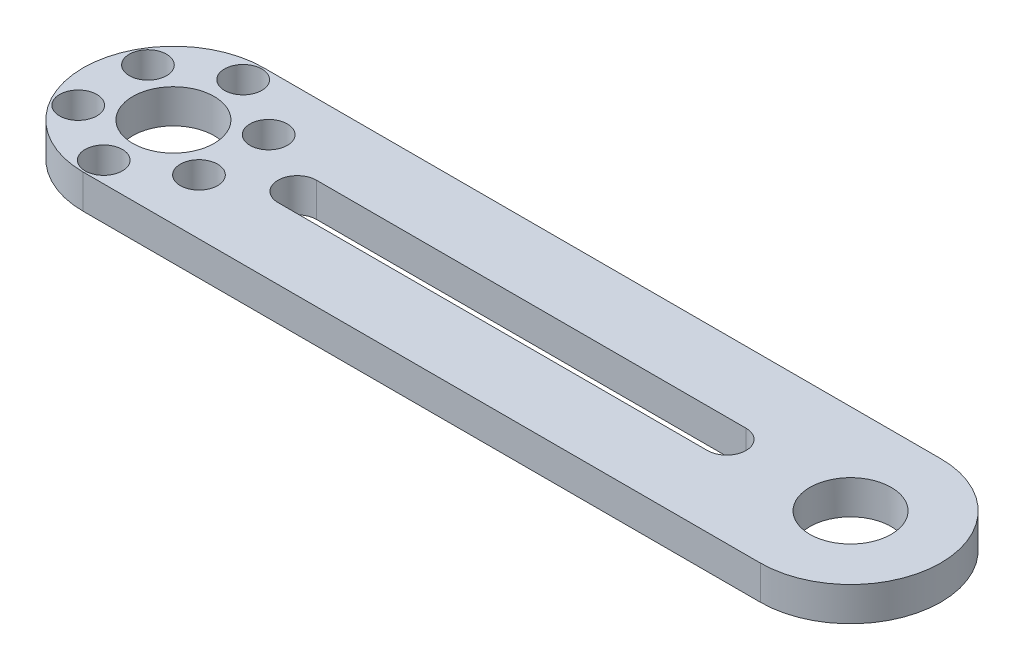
from build123d import *

# Parameters (mm, degrees)
BOSS_EXTRUDE1_DEPTH = 2.56
CUT_EXTRUDE1_REACH  = 68.214
SKETCH2_R           = 6.13
SKETCH2_R_2         = 2.81


with BuildPart() as part:
    # Sketch1 → Boss-Extrude1 (new, symmetric)
    with BuildSketch(Plane(origin=(0, 0, 0), x_dir=(1, 0, 0), z_dir=(0, 1, 0))):
        with BuildLine():
            Line((51, -13.6), (-51, -13.6))
            ThreePointArc((-51, -13.6), (-64.6, 0), (-51, 13.6))
            Line((-51, 13.6), (51, 13.6))
            ThreePointArc((51, 13.6), (64.6, 0), (51, -13.6))
        make_face()
        with BuildLine():
            Line((32.35, -2.91), (-32.35, -2.91))
            ThreePointArc((-32.35, -2.91), (-35.26, 0), (-32.35, 2.91))
            Line((-32.35, 2.91), (32.35, 2.91))
            ThreePointArc((32.35, 2.91), (35.26, 0), (32.35, -2.91))
        make_face(mode=Mode.SUBTRACT)
    extrude(amount=BOSS_EXTRUDE1_DEPTH, both=True)

    # Sketch2 → Cut-Extrude1 (cut, up to next)
    with BuildSketch(Plane(origin=(0, 2.56, 0), x_dir=(1, 0, 0), z_dir=(0, 1, 0)), mode=Mode.PRIVATE) as cut_extrude1_sk1:
        with Locations(Location((-51, 0, 0), (0, 0, 270))):
            Circle(SKETCH2_R)
    cut_extrude1_tool1 = extrude(cut_extrude1_sk1.sketch, amount=-CUT_EXTRUDE1_REACH, mode=Mode.PRIVATE) & part.part
    # Sketch2 → Cut-Extrude1 (cut, up to next)
    with BuildSketch(Plane(origin=(0, 2.56, 0), x_dir=(1, 0, 0), z_dir=(0, 1, 0)), mode=Mode.PRIVATE) as cut_extrude1_sk2:
        with Locations(Location((-51, 10.5, 0), (0, 0, 270))):
            Circle(SKETCH2_R_2)
    cut_extrude1_tool2 = extrude(cut_extrude1_sk2.sketch, amount=-CUT_EXTRUDE1_REACH, mode=Mode.PRIVATE) & part.part
    # Sketch2 → Cut-Extrude1 (cut, up to next)
    with BuildSketch(Plane(origin=(0, 2.56, 0), x_dir=(1, 0, 0), z_dir=(0, 1, 0)), mode=Mode.PRIVATE) as cut_extrude1_sk3:
        with Locations(Location((-41.90673326, 5.25, 0), (0, 0, 270))):
            Circle(SKETCH2_R_2)
    cut_extrude1_tool3 = extrude(cut_extrude1_sk3.sketch, amount=-CUT_EXTRUDE1_REACH, mode=Mode.PRIVATE) & part.part
    # Sketch2 → Cut-Extrude1 (cut, up to next)
    with BuildSketch(Plane(origin=(0, 2.56, 0), x_dir=(1, 0, 0), z_dir=(0, 1, 0)), mode=Mode.PRIVATE) as cut_extrude1_sk4:
        with Locations(Location((-41.90673326, -5.25, 0), (0, 0, 270))):
            Circle(SKETCH2_R_2)
    cut_extrude1_tool4 = extrude(cut_extrude1_sk4.sketch, amount=-CUT_EXTRUDE1_REACH, mode=Mode.PRIVATE) & part.part
    # Sketch2 → Cut-Extrude1 (cut, up to next)
    with BuildSketch(Plane(origin=(0, 2.56, 0), x_dir=(1, 0, 0), z_dir=(0, 1, 0)), mode=Mode.PRIVATE) as cut_extrude1_sk5:
        with Locations(Location((-51, -10.5, 0), (0, 0, 270))):
            Circle(SKETCH2_R_2)
    cut_extrude1_tool5 = extrude(cut_extrude1_sk5.sketch, amount=-CUT_EXTRUDE1_REACH, mode=Mode.PRIVATE) & part.part
    # Sketch2 → Cut-Extrude1 (cut, up to next)
    with BuildSketch(Plane(origin=(0, 2.56, 0), x_dir=(1, 0, 0), z_dir=(0, 1, 0)), mode=Mode.PRIVATE) as cut_extrude1_sk6:
        with Locations(Location((-60.09326674, -5.25, 0), (0, 0, 270))):
            Circle(SKETCH2_R_2)
    cut_extrude1_tool6 = extrude(cut_extrude1_sk6.sketch, amount=-CUT_EXTRUDE1_REACH, mode=Mode.PRIVATE) & part.part
    # Sketch2 → Cut-Extrude1 (cut, up to next)
    with BuildSketch(Plane(origin=(0, 2.56, 0), x_dir=(1, 0, 0), z_dir=(0, 1, 0)), mode=Mode.PRIVATE) as cut_extrude1_sk7:
        with Locations(Location((-60.09326674, 5.25, 0), (0, 0, 270))):
            Circle(SKETCH2_R_2)
    cut_extrude1_tool7 = extrude(cut_extrude1_sk7.sketch, amount=-CUT_EXTRUDE1_REACH, mode=Mode.PRIVATE) & part.part
    # Sketch2 → Cut-Extrude1 (cut, up to next)
    with BuildSketch(Plane(origin=(0, 2.56, 0), x_dir=(1, 0, 0), z_dir=(0, 1, 0)), mode=Mode.PRIVATE) as cut_extrude1_sk8:
        with Locations(Location((51, 0, 0), (0, 0, 270))):
            Circle(SKETCH2_R)
    cut_extrude1_tool8 = extrude(cut_extrude1_sk8.sketch, amount=-CUT_EXTRUDE1_REACH, mode=Mode.PRIVATE) & part.part
    add(cut_extrude1_tool1.solids().sort_by_distance((-51, 2.56, 0))[0], mode=Mode.SUBTRACT)
    add(cut_extrude1_tool2.solids().sort_by_distance((-51, 2.56, -10.5))[0], mode=Mode.SUBTRACT)
    add(cut_extrude1_tool3.solids().sort_by_distance((-41.906733, 2.56, -5.25))[0], mode=Mode.SUBTRACT)
    add(cut_extrude1_tool4.solids().sort_by_distance((-41.906733, 2.56, 5.25))[0], mode=Mode.SUBTRACT)
    add(cut_extrude1_tool5.solids().sort_by_distance((-51, 2.56, 10.5))[0], mode=Mode.SUBTRACT)
    add(cut_extrude1_tool6.solids().sort_by_distance((-60.093267, 2.56, 5.25))[0], mode=Mode.SUBTRACT)
    add(cut_extrude1_tool7.solids().sort_by_distance((-60.093267, 2.56, -5.25))[0], mode=Mode.SUBTRACT)
    add(cut_extrude1_tool8.solids().sort_by_distance((51, 2.56, 0))[0], mode=Mode.SUBTRACT)


solid = part.part
